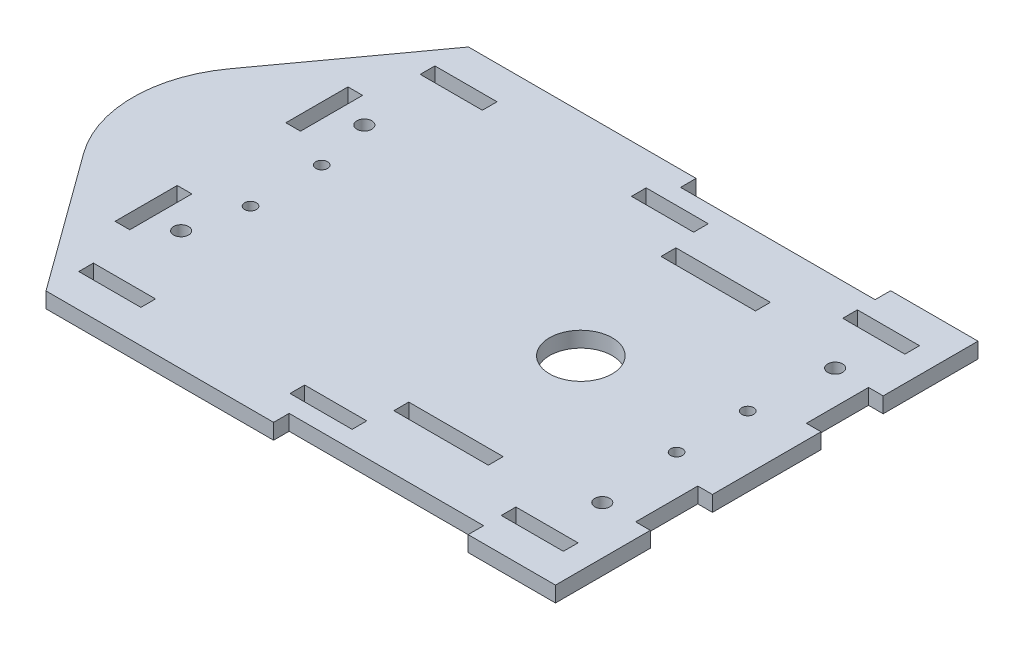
from build123d import *

# Parameters (mm, degrees)
SKETCH1_R      = 1.524
SKETCH1_R_2    = 1.2065
SKETCH1_R_3    = 6.404325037
SKETCH1_W      = 12.7
SKETCH1_H      = 2.9972
SKETCH1_W_2    = 2.9972
SKETCH1_H_2    = 12.7
EXTRUDE2_DEPTH = 3.175
SKETCH2_W      = 39.758144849
SKETCH2_H      = 3.175
EXTRUDE4_DEPTH = 3.175
SKETCH3_W      = 19.304
SKETCH3_H      = 3.048
EXTRUDE5_DEPTH = 3.175


with BuildPart() as part:
    # Sketch1 → Extrude2 (new body)
    with BuildSketch(Plane(origin=(0, 0, 0), x_dir=(1, 0, 0), z_dir=(0, 1, 0))):
        with BuildLine():
            Line((2.768893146, -43.18), (-49.440711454, -43.18))
            Line((-49.440711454, -43.18), (-69.979159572, -14.93952265))
            ThreePointArc((-69.979159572, -14.93952265), (-74.837235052, 0), (-69.979159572, 14.93952265))
            Line((-69.979159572, 14.93952265), (-49.440711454, 43.18))
            Line((-49.440711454, 43.18), (2.768893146, 43.18))
            Line((2.768893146, 43.18), (2.768893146, 40.005))
            Line((2.768893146, 40.005), (11.812588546, 40.005))
            Line((11.812588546, 40.005), (21.591588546, 40.005))
            Line((21.591588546, 40.005), (30.635283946, 40.005))
            Line((30.635283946, 40.005), (30.635283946, 43.18))
            Line((30.635283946, 43.18), (54.699288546, 43.18))
            Line((54.699288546, 43.18), (54.699288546, 23.7998))
            Line((54.699288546, 23.7998), (51.702088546, 23.7998))
            Line((51.702088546, 23.7998), (51.702088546, 11.0998))
            Line((51.702088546, 11.0998), (54.699288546, 11.0998))
            Line((54.699288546, 11.0998), (54.699288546, -11.0998))
            Line((54.699288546, -11.0998), (51.702088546, -11.0998))
            Line((51.702088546, -11.0998), (51.702088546, -23.7998))
            Line((51.702088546, -23.7998), (54.699288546, -23.7998))
            Line((54.699288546, -23.7998), (54.699288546, -43.18))
            Line((54.699288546, -43.18), (30.635283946, -43.18))
            Line((30.635283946, -43.18), (30.635283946, -40.005))
            Line((30.635283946, -40.005), (21.591588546, -40.005))
            Line((21.591588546, -40.005), (11.812588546, -40.005))
            Line((11.812588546, -40.005), (2.768893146, -40.005))
            Line((2.768893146, -40.005), (2.768893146, -43.18))
        make_face()
        with Locations(Location((44.8818, -23.7998, 0), (0, 0, 270))):
            Circle(SKETCH1_R, mode=Mode.SUBTRACT)
        with Locations(Location((-46.2788, -18.7198, 0), (0, 0, 270))):
            Circle(SKETCH1_R, mode=Mode.SUBTRACT)
        with Locations(Location((44.8818, 23.7998, 0), (0, 0, 270))):
            Circle(SKETCH1_R, mode=Mode.SUBTRACT)
        with Locations(Location((-46.2788, 18.7198, 0), (0, 0, 270))):
            Circle(SKETCH1_R, mode=Mode.SUBTRACT)
        with Locations(Location((-43.540008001, 7.271875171, 0), (0, 0, 270))):
            Circle(SKETCH1_R_2, mode=Mode.SUBTRACT)
        with Locations(Location((-43.540008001, -7.271875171, 0), (0, 0, 270))):
            Circle(SKETCH1_R_2, mode=Mode.SUBTRACT)
        with Locations(Location((43.540008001, -7.271875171, 0), (0, 0, 270))):
            Circle(SKETCH1_R_2, mode=Mode.SUBTRACT)
        with Locations(Location((43.540008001, 7.271875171, 0), (0, 0, 270))):
            Circle(SKETCH1_R_2, mode=Mode.SUBTRACT)
        with Locations(Location((16.702088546, 0, 0), (0, 0, 270))):
            Circle(SKETCH1_R_3, mode=Mode.SUBTRACT)
        with Locations((-43.18, -34.8996)):
            Rectangle(SKETCH1_W, SKETCH1_H, mode=Mode.SUBTRACT)
        with Locations((0, -34.8996)):
            Rectangle(SKETCH1_W, SKETCH1_H, mode=Mode.SUBTRACT)
        with Locations((43.18, -34.8996)):
            Rectangle(SKETCH1_W, SKETCH1_H, mode=Mode.SUBTRACT)
        with Locations((-53.200688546, -17.4498)):
            Rectangle(SKETCH1_W_2, SKETCH1_H_2, mode=Mode.SUBTRACT)
        with Locations((43.18, 34.8996)):
            Rectangle(SKETCH1_W, SKETCH1_H, mode=Mode.SUBTRACT)
        with Locations((0, 34.8996)):
            Rectangle(SKETCH1_W, SKETCH1_H, mode=Mode.SUBTRACT)
        with Locations((-43.18, 34.8996)):
            Rectangle(SKETCH1_W, SKETCH1_H, mode=Mode.SUBTRACT)
        with Locations((-53.200688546, 17.4498)):
            Rectangle(SKETCH1_W_2, SKETCH1_H_2, mode=Mode.SUBTRACT)
    extrude(amount=EXTRUDE2_DEPTH)

    # Sketch2 → Extrude4 (cut)
    with BuildSketch(Plane(origin=(0, 3.175, 0), x_dir=(1, 0, 0), z_dir=(0, 1, 0))):
        with Locations((16.959134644, -41.5925)):
            Rectangle(SKETCH2_W, SKETCH2_H)
        with Locations((16.959134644, 41.5925)):
            Rectangle(SKETCH2_W, SKETCH2_H)
    extrude(amount=-EXTRUDE4_DEPTH, mode=Mode.SUBTRACT)

    # Sketch3 → Extrude5 (cut)
    with BuildSketch(Plane(origin=(0, 3.175, 0), x_dir=(-1, 0, 0), z_dir=(0, 1, 0))):
        with Locations((-16.959134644, -27.305)):
            Rectangle(SKETCH3_W, SKETCH3_H)
        with Locations((-16.959134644, 27.305)):
            Rectangle(SKETCH3_W, SKETCH3_H)
    extrude(amount=-EXTRUDE5_DEPTH, mode=Mode.SUBTRACT)


solid = part.part
